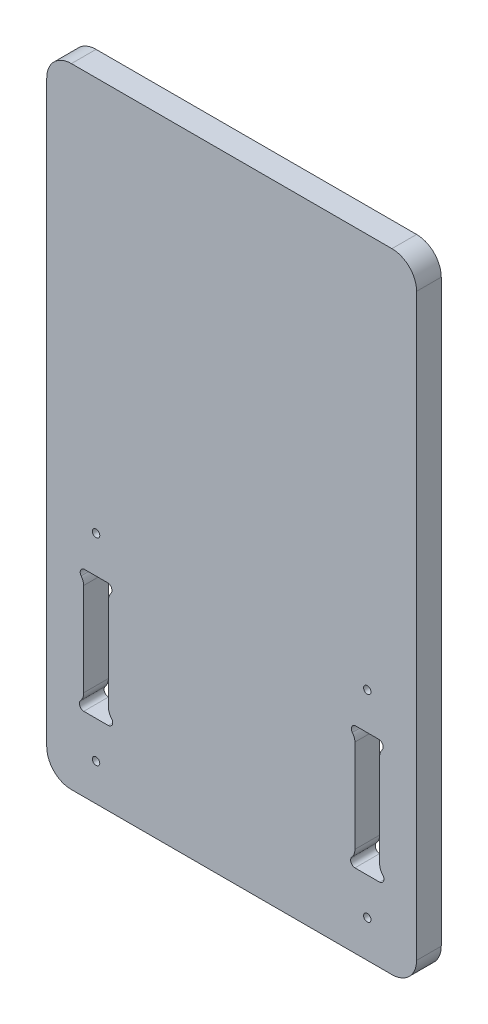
from build123d import *

# Parameters (mm, degrees)
ESQUISSE1_R        = 1.5
BOSS_EXTRU_1_DEPTH = 10


with BuildPart() as part:
    # Esquisse1 → Boss.-Extru.1 (new body)
    with BuildSketch(Plane.XY):
        with BuildLine():
            Line((-65.510099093, -55), (65.102145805, -55))
            ThreePointArc((65.102145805, -55), (72.107273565, -52.035197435), (75, -45))
            Line((75, -45), (75, 190))
            ThreePointArc((75, 190), (72.071067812, 197.071067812), (65, 200))
            Line((65, 200), (-65, 200))
            ThreePointArc((-65, 200), (-72.071067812, 197.071067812), (-75, 190))
            Line((-75, 190), (-75, -45))
            ThreePointArc((-75, -45), (-72.253659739, -51.896661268), (-65.510099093, -55))
        make_face()
        with Locations((-55, -40)):
            Circle(ESQUISSE1_R, mode=Mode.SUBTRACT)
        with Locations(Location((-55, 40, 0), (0, 0, 180))):
            Circle(ESQUISSE1_R, mode=Mode.SUBTRACT)
        with Locations(Location((55, -40, 0), (0, 0, 180))):
            Circle(ESQUISSE1_R, mode=Mode.SUBTRACT)
        with Locations((55, 40)):
            Circle(ESQUISSE1_R, mode=Mode.SUBTRACT)
        with BuildLine():
            Line((-50, -25), (-60, -25))
            ThreePointArc((-60, -25), (-61.589866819, -23.89973653), (-61.377923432, -21.977931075))
            ThreePointArc((-61.377923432, -21.977931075), (-60.356968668, -20.365420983), (-60, -18.490558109))
            Line((-60, -18.490558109), (-60, 19.198937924))
            ThreePointArc((-60, 19.198937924), (-60.312272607, 20.686227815), (-61.048762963, 22.015561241))
            ThreePointArc((-61.048762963, 22.015561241), (-61.333155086, 23.791992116), (-60, 25))
            Line((-60, 25), (-50, 25))
            ThreePointArc((-50, 25), (-48.666844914, 23.791992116), (-48.951237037, 22.015561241))
            ThreePointArc((-48.951237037, 22.015561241), (-49.687727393, 20.686227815), (-50, 19.198937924))
            Line((-50, 19.198937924), (-50, -18.490558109))
            ThreePointArc((-50, -18.490558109), (-49.643031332, -20.365420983), (-48.622076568, -21.977931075))
            ThreePointArc((-48.622076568, -21.977931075), (-48.410133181, -23.89973653), (-50, -25))
        make_face(mode=Mode.SUBTRACT)
        with BuildLine():
            Line((50, -18.490558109), (50, 19.198937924))
            ThreePointArc((50, 19.198937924), (49.687727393, 20.686227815), (48.951237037, 22.015561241))
            ThreePointArc((48.951237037, 22.015561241), (48.666844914, 23.791992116), (50, 25))
            Line((50, 25), (60, 25))
            ThreePointArc((60, 25), (61.333155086, 23.791992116), (61.048762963, 22.015561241))
            ThreePointArc((61.048762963, 22.015561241), (60.312272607, 20.686227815), (60, 19.198937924))
            Line((60, 19.198937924), (60, -18.490558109))
            ThreePointArc((60, -18.490558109), (60.356968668, -20.365420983), (61.377923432, -21.977931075))
            ThreePointArc((61.377923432, -21.977931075), (61.589866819, -23.89973653), (60, -25))
            Line((60, -25), (50, -25))
            ThreePointArc((50, -25), (48.410133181, -23.89973653), (48.622076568, -21.977931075))
            ThreePointArc((48.622076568, -21.977931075), (49.643031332, -20.365420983), (50, -18.490558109))
        make_face(mode=Mode.SUBTRACT)
    extrude(amount=BOSS_EXTRU_1_DEPTH)


solid = part.part
